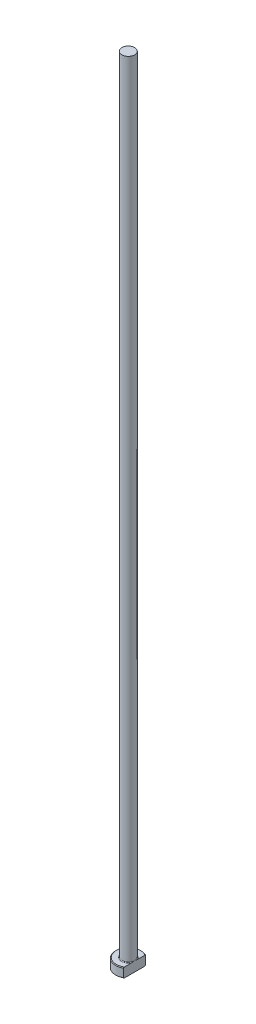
ISO-10303-21;
HEADER;
FILE_DESCRIPTION(('STEP AP214'),'2;1');
FILE_NAME('part.step','',(''),(''),'','','');
FILE_SCHEMA(('AUTOMOTIVE_DESIGN { 1 0 10303 214 1 1 1 1 }'));
ENDSEC;
DATA;
#1=APPLICATION_CONTEXT('core data for automotive mechanical design processes');
#2=APPLICATION_PROTOCOL_DEFINITION('international standard','automotive_design',2000,#1);
#3=PRODUCT_CONTEXT('',#1,'mechanical');
#4=PRODUCT('Part','Part','',(#3));
#5=PRODUCT_RELATED_PRODUCT_CATEGORY('part','',(#4));
#6=PRODUCT_DEFINITION_FORMATION('','',#4);
#7=PRODUCT_DEFINITION_CONTEXT('part definition',#1,'design');
#8=PRODUCT_DEFINITION('design','',#6,#7);
#9=PRODUCT_DEFINITION_SHAPE('','',#8);
#10=(LENGTH_UNIT() NAMED_UNIT(*) SI_UNIT(.MILLI.,.METRE.));
#11=(NAMED_UNIT(*) PLANE_ANGLE_UNIT() SI_UNIT($,.RADIAN.));
#12=(NAMED_UNIT(*) SI_UNIT($,.STERADIAN.) SOLID_ANGLE_UNIT());
#13=UNCERTAINTY_MEASURE_WITH_UNIT(LENGTH_MEASURE(1.E-05),#10,'distance_accuracy_value','');
#14=(GEOMETRIC_REPRESENTATION_CONTEXT(3) GLOBAL_UNCERTAINTY_ASSIGNED_CONTEXT((#13)) GLOBAL_UNIT_ASSIGNED_CONTEXT((#10,
#11,#12)) REPRESENTATION_CONTEXT('',''));
#15=CARTESIAN_POINT('',(0.,0.,0.));
#16=DIRECTION('',(0.,0.,1.));
#17=DIRECTION('',(1.,0.,0.));
#18=AXIS2_PLACEMENT_3D('',#15,#16,#17);
#19=CARTESIAN_POINT('',(0.,0.,0.));
#20=DIRECTION('',(0.,-1.,0.));
#21=DIRECTION('',(0.,0.,-1.));
#22=AXIS2_PLACEMENT_3D('',#19,#20,#21);
#23=PLANE('',#22);
#24=CARTESIAN_POINT('',(0.,0.,0.));
#25=DIRECTION('',(0.,-1.,0.));
#26=DIRECTION('',(0.,0.,-1.));
#27=AXIS2_PLACEMENT_3D('',#24,#25,#26);
#28=CIRCLE('',#27,3.79999999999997);
#29=CARTESIAN_POINT('',(1.99999999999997,0.,3.23109888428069));
#30=VERTEX_POINT('',#29);
#31=CARTESIAN_POINT('',(1.99999999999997,0.,-3.23109888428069));
#32=VERTEX_POINT('',#31);
#33=EDGE_CURVE('E98',#30,#32,#28,.T.);
#34=ORIENTED_EDGE('',*,*,#33,.T.);
#35=DIRECTION('',(0.,0.,1.));
#36=VECTOR('',#35,1.);
#37=CARTESIAN_POINT('',(1.99999999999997,0.,-3.46410161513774));
#38=LINE('',#37,#36);
#39=EDGE_CURVE('E83',#32,#30,#38,.T.);
#40=ORIENTED_EDGE('',*,*,#39,.T.);
#41=EDGE_LOOP('',(#34,#40));
#42=FACE_BOUND('',#41,.T.);
#43=ADVANCED_FACE('F32',(#42),#23,.T.);
#44=CARTESIAN_POINT('',(0.,259.958771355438,0.));
#45=DIRECTION('',(0.,1.,0.));
#46=DIRECTION('',(0.,0.,1.));
#47=AXIS2_PLACEMENT_3D('',#44,#45,#46);
#48=CYLINDRICAL_SURFACE('',#47,3.99999999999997);
#49=CARTESIAN_POINT('',(0.,2.80000000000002,0.));
#50=DIRECTION('',(0.,1.,0.));
#51=DIRECTION('',(0.,0.,1.));
#52=AXIS2_PLACEMENT_3D('',#49,#50,#51);
#53=CIRCLE('',#52,3.99999999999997);
#54=CARTESIAN_POINT('',(1.99999999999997,2.80000000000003,3.46410161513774));
#55=VERTEX_POINT('',#54);
#56=CARTESIAN_POINT('',(1.99999999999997,2.80000000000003,-3.46410161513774));
#57=VERTEX_POINT('',#56);
#58=EDGE_CURVE('E104',#55,#57,#53,.F.);
#59=ORIENTED_EDGE('',*,*,#58,.T.);
#60=DIRECTION('',(0.,-1.,0.));
#61=VECTOR('',#60,1.);
#62=CARTESIAN_POINT('',(1.99999999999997,250.,-3.46410161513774));
#63=LINE('',#62,#61);
#64=CARTESIAN_POINT('',(1.99999999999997,0.200000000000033,-3.46410161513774));
#65=VERTEX_POINT('',#64);
#66=EDGE_CURVE('E183',#57,#65,#63,.T.);
#67=ORIENTED_EDGE('',*,*,#66,.T.);
#68=CARTESIAN_POINT('',(0.,0.200000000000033,0.));
#69=DIRECTION('',(0.,-1.,0.));
#70=DIRECTION('',(0.,0.,-1.));
#71=AXIS2_PLACEMENT_3D('',#68,#69,#70);
#72=CIRCLE('',#71,3.99999999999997);
#73=CARTESIAN_POINT('',(1.99999999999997,0.200000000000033,3.46410161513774));
#74=VERTEX_POINT('',#73);
#75=EDGE_CURVE('E100',#65,#74,#72,.F.);
#76=ORIENTED_EDGE('',*,*,#75,.T.);
#77=DIRECTION('',(0.,-1.,0.));
#78=VECTOR('',#77,1.);
#79=CARTESIAN_POINT('',(1.99999999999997,250.,3.46410161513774));
#80=LINE('',#79,#78);
#81=EDGE_CURVE('E93',#55,#74,#80,.T.);
#82=ORIENTED_EDGE('',*,*,#81,.F.);
#83=EDGE_LOOP('',(#59,#67,#76,#82));
#84=FACE_BOUND('',#83,.T.);
#85=ADVANCED_FACE('F158',(#84),#48,.T.);
#86=CARTESIAN_POINT('',(-3.99999999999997,3.,0.));
#87=DIRECTION('',(0.,1.,0.));
#88=DIRECTION('',(0.,0.,1.));
#89=AXIS2_PLACEMENT_3D('',#86,#87,#88);
#90=PLANE('',#89);
#91=CARTESIAN_POINT('',(0.,3.,0.));
#92=DIRECTION('',(0.,1.,0.));
#93=DIRECTION('',(0.,0.,1.));
#94=AXIS2_PLACEMENT_3D('',#91,#92,#93);
#95=CIRCLE('',#94,3.8);
#96=CARTESIAN_POINT('',(1.99999999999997,3.,-3.23109888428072));
#97=VERTEX_POINT('',#96);
#98=CARTESIAN_POINT('',(1.99999999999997,3.,3.23109888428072));
#99=VERTEX_POINT('',#98);
#100=EDGE_CURVE('E178',#97,#99,#95,.T.);
#101=ORIENTED_EDGE('',*,*,#100,.T.);
#102=DIRECTION('',(0.,0.,-1.));
#103=VECTOR('',#102,1.);
#104=CARTESIAN_POINT('',(1.99999999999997,3.,0.));
#105=LINE('',#104,#103);
#106=CARTESIAN_POINT('',(1.99999999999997,2.99999999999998,0.916515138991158));
#107=VERTEX_POINT('',#106);
#108=EDGE_CURVE('E57',#99,#107,#105,.T.);
#109=ORIENTED_EDGE('',*,*,#108,.T.);
#110=CARTESIAN_POINT('',(0.,3.,0.));
#111=DIRECTION('',(0.,1.,0.));
#112=DIRECTION('',(0.,0.,1.));
#113=AXIS2_PLACEMENT_3D('',#110,#111,#112);
#114=CIRCLE('',#113,2.19999999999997);
#115=CARTESIAN_POINT('',(1.99999999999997,2.99999999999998,-0.9165151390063));
#116=VERTEX_POINT('',#115);
#117=EDGE_CURVE('E107',#107,#116,#114,.F.);
#118=ORIENTED_EDGE('',*,*,#117,.T.);
#119=EDGE_CURVE('E136',#116,#97,#105,.T.);
#120=ORIENTED_EDGE('',*,*,#119,.T.);
#121=EDGE_LOOP('',(#101,#109,#118,#120));
#122=FACE_BOUND('',#121,.T.);
#123=ADVANCED_FACE('F147',(#122),#90,.T.);
#124=CARTESIAN_POINT('',(0.,3.,0.));
#125=DIRECTION('',(0.,-1.,0.));
#126=DIRECTION('',(0.,0.,-1.));
#127=AXIS2_PLACEMENT_3D('',#124,#125,#126);
#128=CONICAL_SURFACE('',#127,3.8,0.785398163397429);
#129=ORIENTED_EDGE('',*,*,#58,.F.);
#130=CARTESIAN_POINT('',(1.99999999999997,-1.08095467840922,7.62295524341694));
#131=CARTESIAN_POINT('',(1.99999999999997,-0.913887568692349,7.45022392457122));
#132=CARTESIAN_POINT('',(1.99999999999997,-0.746999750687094,7.27731861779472));
#133=CARTESIAN_POINT('',(1.99999999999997,-0.413688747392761,6.9310565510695));
#134=CARTESIAN_POINT('',(1.99999999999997,-0.247265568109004,6.75769978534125));
#135=CARTESIAN_POINT('',(1.99999999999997,0.0850908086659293,6.41034692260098));
#136=CARTESIAN_POINT('',(1.99999999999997,0.251023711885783,6.23635054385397));
#137=CARTESIAN_POINT('',(1.99999999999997,0.582155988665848,5.88766284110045));
#138=CARTESIAN_POINT('',(1.99999999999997,0.747355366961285,5.71297152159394));
#139=CARTESIAN_POINT('',(1.99999999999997,1.07353855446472,5.36616839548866));
#140=CARTESIAN_POINT('',(1.99999999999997,1.23454099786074,5.19407412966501));
#141=CARTESIAN_POINT('',(1.99999999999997,1.55534102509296,4.84876663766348));
#142=CARTESIAN_POINT('',(1.99999999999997,1.71513861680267,4.67555341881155));
#143=CARTESIAN_POINT('',(1.99999999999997,2.03306183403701,4.32766569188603));
#144=CARTESIAN_POINT('',(1.99999999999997,2.19118781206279,4.15299150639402));
#145=CARTESIAN_POINT('',(1.99999999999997,2.5051394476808,3.80159134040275));
#146=CARTESIAN_POINT('',(1.99999999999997,2.66096519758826,3.62486544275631));
#147=CARTESIAN_POINT('',(1.99999999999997,2.90974646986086,3.33722425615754));
#148=CARTESIAN_POINT('',(1.99999999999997,3.00376148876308,3.22722645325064));
#149=CARTESIAN_POINT('',(1.99999999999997,3.1901182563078,3.00579987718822));
#150=CARTESIAN_POINT('',(1.99999999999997,3.28245983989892,2.89437096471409));
#151=CARTESIAN_POINT('',(1.99999999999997,3.46586188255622,2.66849662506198));
#152=CARTESIAN_POINT('',(1.99999999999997,3.55689849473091,2.55403176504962));
#153=CARTESIAN_POINT('',(1.99999999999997,3.73578809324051,2.32266819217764));
#154=CARTESIAN_POINT('',(1.99999999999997,3.82364184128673,2.20577007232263));
#155=CARTESIAN_POINT('',(1.99999999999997,3.9961275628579,1.96688707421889));
#156=CARTESIAN_POINT('',(1.99999999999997,4.08069035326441,1.84485190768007));
#157=CARTESIAN_POINT('',(1.99999999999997,4.24300264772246,1.59599329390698));
#158=CARTESIAN_POINT('',(1.99999999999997,4.32074277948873,1.46916359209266));
#159=CARTESIAN_POINT('',(1.99999999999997,4.4286976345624,1.27510066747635));
#160=CARTESIAN_POINT('',(1.99999999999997,4.46305374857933,1.21018943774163));
#161=CARTESIAN_POINT('',(1.99999999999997,4.5283714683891,1.07868835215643));
#162=CARTESIAN_POINT('',(1.99999999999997,4.55933245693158,1.01209819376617));
#163=CARTESIAN_POINT('',(1.99999999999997,4.64566860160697,0.80989435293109));
#164=CARTESIAN_POINT('',(1.99999999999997,4.6947821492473,0.671360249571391));
#165=CARTESIAN_POINT('',(1.99999999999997,4.74794829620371,0.46365745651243));
#166=CARTESIAN_POINT('',(1.99999999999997,4.76205065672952,0.397033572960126));
#167=CARTESIAN_POINT('',(1.99999999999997,4.78390371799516,0.262728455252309));
#168=CARTESIAN_POINT('',(1.99999999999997,4.79165498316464,0.195047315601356));
#169=CARTESIAN_POINT('',(1.99999999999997,4.8002569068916,0.0594528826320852));
#170=CARTESIAN_POINT('',(1.99999999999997,4.80112894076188,-0.00845903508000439));
#171=CARTESIAN_POINT('',(1.99999999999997,4.79596585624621,-0.144020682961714));
#172=CARTESIAN_POINT('',(1.99999999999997,4.78993016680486,-0.211670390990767));
#173=CARTESIAN_POINT('',(1.99999999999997,4.77145363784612,-0.34548399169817));
#174=CARTESIAN_POINT('',(1.99999999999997,4.75906777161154,-0.411655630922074));
#175=CARTESIAN_POINT('',(1.99999999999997,4.72866360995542,-0.542678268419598));
#176=CARTESIAN_POINT('',(1.99999999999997,4.71064463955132,-0.60752910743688));
#177=CARTESIAN_POINT('',(1.99999999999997,4.66972939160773,-0.736064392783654));
#178=CARTESIAN_POINT('',(1.99999999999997,4.64680564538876,-0.799739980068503));
#179=CARTESIAN_POINT('',(1.99999999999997,4.59700147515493,-0.925489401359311));
#180=CARTESIAN_POINT('',(1.99999999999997,4.57012185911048,-0.987563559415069));
#181=CARTESIAN_POINT('',(1.99999999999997,4.48443518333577,-1.17209020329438));
#182=CARTESIAN_POINT('',(1.99999999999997,4.42077407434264,-1.29228210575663));
#183=CARTESIAN_POINT('',(1.99999999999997,4.2850264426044,-1.52785770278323));
#184=CARTESIAN_POINT('',(1.99999999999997,4.21292931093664,-1.64323509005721));
#185=CARTESIAN_POINT('',(1.99999999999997,4.06281517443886,-1.87069387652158));
#186=CARTESIAN_POINT('',(1.99999999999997,3.9847759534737,-1.98276048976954));
#187=CARTESIAN_POINT('',(1.99999999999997,3.82481971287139,-2.20397837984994));
#188=CARTESIAN_POINT('',(1.99999999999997,3.74290465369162,-2.31313108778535));
#189=CARTESIAN_POINT('',(1.99999999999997,3.57517222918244,-2.53068545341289));
#190=CARTESIAN_POINT('',(1.99999999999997,3.4893176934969,-2.63905831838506));
#191=CARTESIAN_POINT('',(1.99999999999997,3.31548151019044,-2.85409686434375));
#192=CARTESIAN_POINT('',(1.99999999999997,3.22749963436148,-2.96076236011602));
#193=CARTESIAN_POINT('',(1.99999999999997,3.05015030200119,-3.17249211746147));
#194=CARTESIAN_POINT('',(1.99999999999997,2.96078672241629,-3.27755963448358));
#195=CARTESIAN_POINT('',(1.99999999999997,2.78082366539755,-3.48663191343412));
#196=CARTESIAN_POINT('',(1.99999999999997,2.69022416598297,-3.5906366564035));
#197=CARTESIAN_POINT('',(1.99999999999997,2.44796733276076,-3.86612439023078));
#198=CARTESIAN_POINT('',(1.99999999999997,2.29545972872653,-4.03685912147));
#199=CARTESIAN_POINT('',(1.99999999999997,1.98858070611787,-4.37664803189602));
#200=CARTESIAN_POINT('',(1.99999999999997,1.83420923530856,-4.54570216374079));
#201=CARTESIAN_POINT('',(1.99999999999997,1.52396102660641,-4.88271638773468));
#202=CARTESIAN_POINT('',(1.99999999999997,1.36808300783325,-5.05067529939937));
#203=CARTESIAN_POINT('',(1.99999999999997,1.05530513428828,-5.38563883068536));
#204=CARTESIAN_POINT('',(1.99999999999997,0.898405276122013,-5.55264344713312));
#205=CARTESIAN_POINT('',(1.99999999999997,0.590290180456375,-5.87905385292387));
#206=CARTESIAN_POINT('',(1.99999999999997,0.439106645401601,-6.03848959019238));
#207=CARTESIAN_POINT('',(1.99999999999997,0.136164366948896,-6.35681456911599));
#208=CARTESIAN_POINT('',(1.99999999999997,-0.0155943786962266,-6.51570380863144));
#209=CARTESIAN_POINT('',(1.99999999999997,-0.319404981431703,-6.83286192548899));
#210=CARTESIAN_POINT('',(1.99999999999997,-0.471456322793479,-6.99113129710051));
#211=CARTESIAN_POINT('',(1.99999999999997,-0.775939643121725,-7.30730102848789));
#212=CARTESIAN_POINT('',(1.99999999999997,-0.928371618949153,-7.46520139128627));
#213=CARTESIAN_POINT('',(1.99999999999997,-1.08095467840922,-7.62295524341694));
#214=B_SPLINE_CURVE_WITH_KNOTS('',3,(#130,#131,#132,#133,#134,#135,#136,#137,#138,#139,#140,
#141,#142,#143,#144,#145,#146,#147,#148,#149,#150,#151,#152,#153,#154,#155,#156,#157,#158,#159,
#160,#161,#162,#163,#164,#165,#166,#167,#168,#169,#170,#171,#172,#173,#174,#175,#176,#177,#178,
#179,#180,#181,#182,#183,#184,#185,#186,#187,#188,#189,#190,#191,#192,#193,#194,#195,#196,#197,
#198,#199,#200,#201,#202,#203,#204,#205,#206,#207,#208,#209,#210,#211,#212,#213),.UNSPECIFIED.,
.F.,.F.,(4,2,2,2,2,2,2,2,2,2,2,2,2,2,2,2,2,2,2,2,2,2,2,2,2,2,2,2,2,2,2,2,2,2,2,2,2,2,2,2,2,4),
(0.,0.720921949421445,1.44185317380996,2.1631532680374,2.88444869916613,3.59144103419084,
4.29842874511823,5.005264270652,5.71207135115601,6.14616174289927,6.58029471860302,
7.01901494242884,7.45762947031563,7.90290456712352,8.34878206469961,8.56901415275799,
8.7892862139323,9.22814472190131,9.43219512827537,9.63622739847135,9.8396254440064,
10.0430403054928,10.2447232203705,10.4464303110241,10.6492980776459,10.8521244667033,
11.259558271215,11.6675100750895,12.0770700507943,12.4864250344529,12.901167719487,
13.3159550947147,13.7297367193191,14.1435257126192,14.8302935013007,15.5170805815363,
16.2045145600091,16.8919508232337,17.5511045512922,18.2102608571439,18.86868195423,
19.5270976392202),.UNSPECIFIED.);
#215=EDGE_CURVE('E135',#55,#99,#214,.T.);
#216=ORIENTED_EDGE('',*,*,#215,.T.);
#217=ORIENTED_EDGE('',*,*,#100,.F.);
#218=EDGE_CURVE('E127',#97,#57,#214,.T.);
#219=ORIENTED_EDGE('',*,*,#218,.T.);
#220=EDGE_LOOP('',(#129,#216,#217,#219));
#221=FACE_BOUND('',#220,.T.);
#222=ADVANCED_FACE('F143',(#221),#128,.T.);
#223=CARTESIAN_POINT('',(0.,0.200000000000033,0.));
#224=DIRECTION('',(0.,1.,0.));
#225=DIRECTION('',(0.,0.,1.));
#226=AXIS2_PLACEMENT_3D('',#223,#224,#225);
#227=CONICAL_SURFACE('',#226,3.99999999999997,0.785398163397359);
#228=ORIENTED_EDGE('',*,*,#75,.F.);
#229=CARTESIAN_POINT('',(1.99999999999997,4.08095467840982,-7.62295524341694));
#230=CARTESIAN_POINT('',(1.99999999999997,3.9138875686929,-7.4502239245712));
#231=CARTESIAN_POINT('',(1.99999999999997,3.74699975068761,-7.27731861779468));
#232=CARTESIAN_POINT('',(1.99999999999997,3.4136887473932,-6.93105655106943));
#233=CARTESIAN_POINT('',(1.99999999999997,3.2472655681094,-6.75769978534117));
#234=CARTESIAN_POINT('',(1.99999999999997,2.91490919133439,-6.41034692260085));
#235=CARTESIAN_POINT('',(1.99999999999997,2.74897628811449,-6.23635054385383));
#236=CARTESIAN_POINT('',(1.99999999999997,2.41784401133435,-5.88766284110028));
#237=CARTESIAN_POINT('',(1.99999999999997,2.25264463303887,-5.71297152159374));
#238=CARTESIAN_POINT('',(1.99999999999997,1.92646144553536,-5.36616839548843));
#239=CARTESIAN_POINT('',(1.99999999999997,1.7654590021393,-5.19407412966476));
#240=CARTESIAN_POINT('',(1.99999999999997,1.44465897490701,-4.8487666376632));
#241=CARTESIAN_POINT('',(1.99999999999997,1.28486138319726,-4.67555341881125));
#242=CARTESIAN_POINT('',(1.99999999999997,0.966938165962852,-4.3276656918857));
#243=CARTESIAN_POINT('',(1.99999999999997,0.808812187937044,-4.15299150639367));
#244=CARTESIAN_POINT('',(1.99999999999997,0.494860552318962,-3.80159134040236));
#245=CARTESIAN_POINT('',(1.99999999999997,0.339034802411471,-3.62486544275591));
#246=CARTESIAN_POINT('',(1.99999999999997,0.0902535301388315,-3.33722425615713));
#247=CARTESIAN_POINT('',(1.99999999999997,-0.00376148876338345,-3.22722645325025));
#248=CARTESIAN_POINT('',(1.99999999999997,-0.190118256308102,-3.00579987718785));
#249=CARTESIAN_POINT('',(1.99999999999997,-0.282459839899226,-2.89437096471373));
#250=CARTESIAN_POINT('',(1.99999999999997,-0.465861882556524,-2.66849662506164));
#251=CARTESIAN_POINT('',(1.99999999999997,-0.556898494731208,-2.55403176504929));
#252=CARTESIAN_POINT('',(1.99999999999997,-0.735788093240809,-2.32266819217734));
#253=CARTESIAN_POINT('',(1.99999999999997,-0.82364184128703,-2.20577007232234));
#254=CARTESIAN_POINT('',(1.99999999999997,-0.996127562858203,-1.96688707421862));
#255=CARTESIAN_POINT('',(1.99999999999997,-1.08069035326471,-1.84485190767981));
#256=CARTESIAN_POINT('',(1.99999999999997,-1.24300264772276,-1.59599329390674));
#257=CARTESIAN_POINT('',(1.99999999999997,-1.32074277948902,-1.46916359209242));
#258=CARTESIAN_POINT('',(1.99999999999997,-1.42869763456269,-1.27510066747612));
#259=CARTESIAN_POINT('',(1.99999999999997,-1.46305374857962,-1.2101894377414));
#260=CARTESIAN_POINT('',(1.99999999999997,-1.52837146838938,-1.07868835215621));
#261=CARTESIAN_POINT('',(1.99999999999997,-1.55933245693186,-1.01209819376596));
#262=CARTESIAN_POINT('',(1.99999999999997,-1.64566860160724,-0.80989435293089));
#263=CARTESIAN_POINT('',(1.99999999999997,-1.69478214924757,-0.671360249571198));
#264=CARTESIAN_POINT('',(1.99999999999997,-1.74794829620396,-0.463657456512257));
#265=CARTESIAN_POINT('',(1.99999999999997,-1.76205065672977,-0.397033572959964));
#266=CARTESIAN_POINT('',(1.99999999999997,-1.78390371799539,-0.262728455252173));
#267=CARTESIAN_POINT('',(1.99999999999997,-1.79165498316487,-0.195047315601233));
#268=CARTESIAN_POINT('',(1.99999999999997,-1.80025690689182,-0.0594528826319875));
#269=CARTESIAN_POINT('',(1.99999999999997,-1.8011289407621,0.00845903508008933));
#270=CARTESIAN_POINT('',(1.99999999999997,-1.79596585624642,0.144020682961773));
#271=CARTESIAN_POINT('',(1.99999999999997,-1.78993016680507,0.211670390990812));
#272=CARTESIAN_POINT('',(1.99999999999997,-1.77145363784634,0.345483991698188));
#273=CARTESIAN_POINT('',(1.99999999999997,-1.75906777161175,0.411655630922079));
#274=CARTESIAN_POINT('',(1.99999999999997,-1.72866360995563,0.542678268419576));
#275=CARTESIAN_POINT('',(1.99999999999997,-1.71064463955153,0.607529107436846));
#276=CARTESIAN_POINT('',(1.99999999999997,-1.66972939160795,0.736064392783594));
#277=CARTESIAN_POINT('',(1.99999999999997,-1.64680564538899,0.799739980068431));
#278=CARTESIAN_POINT('',(1.99999999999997,-1.59700147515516,0.925489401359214));
#279=CARTESIAN_POINT('',(1.99999999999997,-1.57012185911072,0.987563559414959));
#280=CARTESIAN_POINT('',(1.99999999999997,-1.48443518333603,1.17209020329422));
#281=CARTESIAN_POINT('',(1.99999999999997,-1.42077407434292,1.29228210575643));
#282=CARTESIAN_POINT('',(1.99999999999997,-1.28502644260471,1.52785770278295));
#283=CARTESIAN_POINT('',(1.99999999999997,-1.21292931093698,1.6432350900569));
#284=CARTESIAN_POINT('',(1.99999999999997,-1.06281517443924,1.87069387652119));
#285=CARTESIAN_POINT('',(1.99999999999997,-0.984775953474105,1.98276048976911));
#286=CARTESIAN_POINT('',(1.99999999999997,-0.824819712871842,2.20397837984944));
#287=CARTESIAN_POINT('',(1.99999999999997,-0.742904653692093,2.31313108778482));
#288=CARTESIAN_POINT('',(1.99999999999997,-0.575172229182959,2.53068545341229));
#289=CARTESIAN_POINT('',(1.99999999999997,-0.489317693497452,2.63905831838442));
#290=CARTESIAN_POINT('',(1.99999999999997,-0.315481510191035,2.85409686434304));
#291=CARTESIAN_POINT('',(1.99999999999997,-0.227499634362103,2.96076236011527));
#292=CARTESIAN_POINT('',(1.99999999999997,-0.0501503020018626,3.17249211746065));
#293=CARTESIAN_POINT('',(1.99999999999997,0.0392132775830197,3.27755963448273));
#294=CARTESIAN_POINT('',(1.99999999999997,0.219176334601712,3.48663191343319));
#295=CARTESIAN_POINT('',(1.99999999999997,0.309775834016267,3.59063665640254));
#296=CARTESIAN_POINT('',(1.99999999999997,0.552032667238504,3.86612439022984));
#297=CARTESIAN_POINT('',(1.99999999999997,0.70454027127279,4.0368591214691));
#298=CARTESIAN_POINT('',(1.99999999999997,1.01141929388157,4.37664803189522));
#299=CARTESIAN_POINT('',(1.99999999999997,1.16579076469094,4.54570216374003));
#300=CARTESIAN_POINT('',(1.99999999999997,1.47603897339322,4.88271638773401));
#301=CARTESIAN_POINT('',(1.99999999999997,1.63191699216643,5.05067529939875));
#302=CARTESIAN_POINT('',(1.99999999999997,1.94469486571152,5.38563883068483));
#303=CARTESIAN_POINT('',(1.99999999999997,2.10159472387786,5.55264344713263));
#304=CARTESIAN_POINT('',(1.99999999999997,2.40970981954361,5.87905385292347));
#305=CARTESIAN_POINT('',(1.99999999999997,2.56089335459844,6.03848959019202));
#306=CARTESIAN_POINT('',(1.99999999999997,2.86383563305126,6.35681456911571));
#307=CARTESIAN_POINT('',(1.99999999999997,3.01559437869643,6.51570380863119));
#308=CARTESIAN_POINT('',(1.99999999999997,3.31940498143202,6.83286192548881));
#309=CARTESIAN_POINT('',(1.99999999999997,3.47145632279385,6.99113129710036));
#310=CARTESIAN_POINT('',(1.99999999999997,3.77593964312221,7.30730102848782));
#311=CARTESIAN_POINT('',(1.99999999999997,3.92837161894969,7.46520139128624));
#312=CARTESIAN_POINT('',(1.99999999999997,4.08095467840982,7.62295524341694));
#313=B_SPLINE_CURVE_WITH_KNOTS('',3,(#229,#230,#231,#232,#233,#234,#235,#236,#237,#238,#239,
#240,#241,#242,#243,#244,#245,#246,#247,#248,#249,#250,#251,#252,#253,#254,#255,#256,#257,#258,
#259,#260,#261,#262,#263,#264,#265,#266,#267,#268,#269,#270,#271,#272,#273,#274,#275,#276,#277,
#278,#279,#280,#281,#282,#283,#284,#285,#286,#287,#288,#289,#290,#291,#292,#293,#294,#295,#296,
#297,#298,#299,#300,#301,#302,#303,#304,#305,#306,#307,#308,#309,#310,#311,#312),.UNSPECIFIED.,
.F.,.F.,(4,2,2,2,2,2,2,2,2,2,2,2,2,2,2,2,2,2,2,2,2,2,2,2,2,2,2,2,2,2,2,2,2,2,2,2,2,2,2,2,2,4),
(0.,0.720921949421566,1.4418531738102,2.16315326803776,2.88444869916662,3.59144103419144,
4.29842874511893,5.00526427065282,5.71207135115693,6.14616174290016,6.58029471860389,
7.01901494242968,7.45762947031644,7.90290456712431,8.34878206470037,8.56901415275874,
8.78928621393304,9.22814472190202,9.43219512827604,9.63622739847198,9.83962544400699,
10.0430403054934,10.244723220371,10.4464303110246,10.6492980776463,10.8521244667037,
11.2595582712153,11.6675100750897,12.0770700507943,12.4864250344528,12.9011677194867,
13.3159550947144,13.7297367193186,14.1435257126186,14.8302935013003,15.5170805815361,
16.2045145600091,16.891950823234,17.5511045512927,18.2102608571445,18.8686819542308,
19.5270976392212),.UNSPECIFIED.);
#314=EDGE_CURVE('E86',#65,#32,#313,.T.);
#315=ORIENTED_EDGE('',*,*,#314,.T.);
#316=ORIENTED_EDGE('',*,*,#33,.F.);
#317=EDGE_CURVE('E89',#30,#74,#313,.T.);
#318=ORIENTED_EDGE('',*,*,#317,.T.);
#319=EDGE_LOOP('',(#228,#315,#316,#318));
#320=FACE_BOUND('',#319,.T.);
#321=ADVANCED_FACE('F97',(#320),#227,.T.);
#322=CARTESIAN_POINT('',(0.,3.19999999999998,0.));
#323=DIRECTION('',(0.,1.,0.));
#324=DIRECTION('',(0.,0.,1.));
#325=AXIS2_PLACEMENT_3D('',#322,#323,#324);
#326=TOROIDAL_SURFACE('',#325,2.19999999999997,0.2);
#327=CARTESIAN_POINT('',(1.99999999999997,3.19999999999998,0.));
#328=CARTESIAN_POINT('',(1.99999999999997,3.20000050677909,1.13930257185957E-10));
#329=CARTESIAN_POINT('',(1.99999999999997,3.20000101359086,-1.46766790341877E-07));
#330=CARTESIAN_POINT('',(1.99999999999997,3.20000197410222,-5.82067439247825E-07));
#331=CARTESIAN_POINT('',(1.99999999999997,3.20000242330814,-8.77873003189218E-07));
#332=CARTESIAN_POINT('',(1.99999999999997,3.20000333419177,-1.58424512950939E-06));
#333=CARTESIAN_POINT('',(1.99999999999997,3.20000378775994,-2.00534281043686E-06));
#334=CARTESIAN_POINT('',(1.99999999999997,3.20000462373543,-2.89558838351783E-06));
#335=CARTESIAN_POINT('',(1.99999999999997,3.20000500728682,-3.3637232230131E-06));
#336=CARTESIAN_POINT('',(1.99999999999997,3.20000636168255,-5.10887545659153E-06));
#337=CARTESIAN_POINT('',(1.99999999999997,3.2000072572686,-6.44597273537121E-06));
#338=CARTESIAN_POINT('',(1.99999999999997,3.20000879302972,-9.14926709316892E-06));
#339=CARTESIAN_POINT('',(1.99999999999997,3.20000944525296,-1.05089714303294E-05));
#340=CARTESIAN_POINT('',(1.99999999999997,3.20001204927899,-1.60555879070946E-05));
#341=CARTESIAN_POINT('',(1.99999999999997,3.20001390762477,-2.02908746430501E-05));
#342=CARTESIAN_POINT('',(1.99999999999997,3.20001676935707,-2.84438492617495E-05));
#343=CARTESIAN_POINT('',(1.99999999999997,3.2000178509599,-3.23343257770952E-05));
#344=CARTESIAN_POINT('',(1.99999999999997,3.20002551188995,-6.06027142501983E-05));
#345=CARTESIAN_POINT('',(1.99999999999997,3.20003111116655,-8.51991843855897E-05));
#346=CARTESIAN_POINT('',(1.99999999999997,3.20005559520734,-0.000181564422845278));
#347=CARTESIAN_POINT('',(1.99999999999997,3.20007914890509,-0.00025209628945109));
#348=CARTESIAN_POINT('',(1.99999999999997,3.20017002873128,-0.000529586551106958));
#349=CARTESIAN_POINT('',(1.99999999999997,3.20023415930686,-0.000737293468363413));
#350=CARTESIAN_POINT('',(1.99999999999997,3.20048926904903,-0.00155657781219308));
#351=CARTESIAN_POINT('',(1.99999999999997,3.20068414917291,-0.00216722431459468));
#352=CARTESIAN_POINT('',(1.99999999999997,3.20148805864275,-0.00469384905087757));
#353=CARTESIAN_POINT('',(1.99999999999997,3.20209226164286,-0.00661098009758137));
#354=CARTESIAN_POINT('',(1.99999999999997,3.20822779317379,-0.026069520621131));
#355=CARTESIAN_POINT('',(1.99999999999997,3.21378174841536,-0.0436057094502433));
#356=CARTESIAN_POINT('',(1.99999999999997,3.22462834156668,-0.0780127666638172));
#357=CARTESIAN_POINT('',(1.99999999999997,3.2299227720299,-0.0948831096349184));
#358=CARTESIAN_POINT('',(1.99999999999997,3.24110477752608,-0.130713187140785));
#359=CARTESIAN_POINT('',(1.99999999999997,3.24698536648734,-0.149675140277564));
#360=CARTESIAN_POINT('',(1.99999999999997,3.2586983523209,-0.187834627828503));
#361=CARTESIAN_POINT('',(1.99999999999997,3.26452957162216,-0.207032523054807));
#362=CARTESIAN_POINT('',(1.99999999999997,3.27861584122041,-0.254071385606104));
#363=CARTESIAN_POINT('',(1.99999999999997,3.28678835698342,-0.281937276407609));
#364=CARTESIAN_POINT('',(1.99999999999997,3.30249503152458,-0.337115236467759));
#365=CARTESIAN_POINT('',(1.99999999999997,3.31003989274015,-0.36442425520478));
#366=CARTESIAN_POINT('',(1.99999999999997,3.32554795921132,-0.422841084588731));
#367=CARTESIAN_POINT('',(1.99999999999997,3.33343288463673,-0.453970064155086));
#368=CARTESIAN_POINT('',(1.99999999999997,3.34833120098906,-0.516667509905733));
#369=CARTESIAN_POINT('',(1.99999999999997,3.3553379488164,-0.548237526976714));
#370=CARTESIAN_POINT('',(1.99999999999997,3.37554978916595,-0.647984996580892));
#371=CARTESIAN_POINT('',(1.99999999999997,3.38665117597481,-0.716635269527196));
#372=CARTESIAN_POINT('',(1.99999999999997,3.39785773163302,-0.832445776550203));
#373=CARTESIAN_POINT('',(1.99999999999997,3.40036304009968,-0.879345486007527));
#374=CARTESIAN_POINT('',(1.99999999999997,3.3997602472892,-0.94923898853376));
#375=CARTESIAN_POINT('',(1.99999999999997,3.39886048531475,-0.972248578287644));
#376=CARTESIAN_POINT('',(1.99999999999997,3.39534463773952,-1.01812773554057));
#377=CARTESIAN_POINT('',(1.99999999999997,3.39273014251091,-1.04099741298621));
#378=CARTESIAN_POINT('',(1.99999999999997,3.38623968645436,-1.08102660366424));
#379=CARTESIAN_POINT('',(1.99999999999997,3.38280841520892,-1.09825717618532));
#380=CARTESIAN_POINT('',(1.99999999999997,3.37442567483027,-1.13243508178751));
#381=CARTESIAN_POINT('',(1.99999999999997,3.36946777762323,-1.14938089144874));
#382=CARTESIAN_POINT('',(1.99999999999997,3.35764172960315,-1.18276398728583));
#383=CARTESIAN_POINT('',(1.99999999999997,3.3507581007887,-1.19919590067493));
#384=CARTESIAN_POINT('',(1.99999999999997,3.33462082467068,-1.23083581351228));
#385=CARTESIAN_POINT('',(1.99999999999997,3.32537783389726,-1.24604892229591));
#386=CARTESIAN_POINT('',(1.99999999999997,3.30929159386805,-1.26715296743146));
#387=CARTESIAN_POINT('',(1.99999999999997,3.30356769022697,-1.27389441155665));
#388=CARTESIAN_POINT('',(1.99999999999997,3.29128925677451,-1.28659894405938));
#389=CARTESIAN_POINT('',(1.99999999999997,3.28473413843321,-1.2925614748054));
#390=CARTESIAN_POINT('',(1.99999999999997,3.27066594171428,-1.30346436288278));
#391=CARTESIAN_POINT('',(1.99999999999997,3.26314132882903,-1.30839014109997));
#392=CARTESIAN_POINT('',(1.99999999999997,3.24727957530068,-1.31668687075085));
#393=CARTESIAN_POINT('',(1.99999999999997,3.23894498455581,-1.32006252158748));
#394=CARTESIAN_POINT('',(1.99999999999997,3.22424089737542,-1.3241557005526));
#395=CARTESIAN_POINT('',(1.99999999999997,3.21800630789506,-1.32536112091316));
#396=CARTESIAN_POINT('',(1.99999999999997,3.20542266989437,-1.32669615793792));
#397=CARTESIAN_POINT('',(1.99999999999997,3.19907368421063,-1.32682634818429));
#398=CARTESIAN_POINT('',(1.99999999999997,3.18645152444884,-1.32599950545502));
#399=CARTESIAN_POINT('',(1.99999999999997,3.18017831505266,-1.32504300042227));
#400=CARTESIAN_POINT('',(1.99999999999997,3.16787181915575,-1.32212308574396));
#401=CARTESIAN_POINT('',(1.99999999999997,3.16183869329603,-1.3201590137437));
#402=CARTESIAN_POINT('',(1.99999999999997,3.14844260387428,-1.3146656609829));
#403=CARTESIAN_POINT('',(1.99999999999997,3.14119825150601,-1.31084826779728));
#404=CARTESIAN_POINT('',(1.99999999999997,3.12742328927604,-1.30209252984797));
#405=CARTESIAN_POINT('',(1.99999999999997,3.12089414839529,-1.2971519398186));
#406=CARTESIAN_POINT('',(1.99999999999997,3.10554761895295,-1.28382084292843));
#407=CARTESIAN_POINT('',(1.99999999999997,3.09717242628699,-1.27492468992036));
#408=CARTESIAN_POINT('',(1.99999999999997,3.08188323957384,-1.25597903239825));
#409=CARTESIAN_POINT('',(1.99999999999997,3.07497120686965,-1.24592800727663));
#410=CARTESIAN_POINT('',(1.99999999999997,3.05771073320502,-1.21734573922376));
#411=CARTESIAN_POINT('',(1.99999999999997,3.04862251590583,-1.19806017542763));
#412=CARTESIAN_POINT('',(1.99999999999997,3.03323781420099,-1.15830155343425));
#413=CARTESIAN_POINT('',(1.99999999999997,3.02696471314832,-1.13782009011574));
#414=CARTESIAN_POINT('',(1.99999999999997,3.0165915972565,-1.09607450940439));
#415=CARTESIAN_POINT('',(1.99999999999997,3.0125177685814,-1.07480405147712));
#416=CARTESIAN_POINT('',(1.99999999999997,3.00618909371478,-1.03196822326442));
#417=CARTESIAN_POINT('',(1.99999999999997,3.00393768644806,-1.01040237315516));
#418=CARTESIAN_POINT('',(1.99999999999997,2.99950887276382,-0.94694819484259));
#419=CARTESIAN_POINT('',(1.99999999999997,2.99937097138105,-0.904921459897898));
#420=CARTESIAN_POINT('',(1.99999999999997,3.00391139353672,-0.800067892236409));
#421=CARTESIAN_POINT('',(1.99999999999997,3.01103947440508,-0.7373784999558));
#422=CARTESIAN_POINT('',(1.99999999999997,3.0310998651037,-0.611444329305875));
#423=CARTESIAN_POINT('',(1.99999999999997,3.04417074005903,-0.548223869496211));
#424=CARTESIAN_POINT('',(1.99999999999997,3.06920011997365,-0.442888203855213));
#425=CARTESIAN_POINT('',(1.99999999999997,3.08016343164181,-0.40052705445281));
#426=CARTESIAN_POINT('',(1.99999999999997,3.10315303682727,-0.316588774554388));
#427=CARTESIAN_POINT('',(1.99999999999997,3.11516655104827,-0.275008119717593));
#428=CARTESIAN_POINT('',(1.99999999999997,3.13853403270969,-0.196672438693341));
#429=CARTESIAN_POINT('',(1.99999999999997,3.14981294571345,-0.159894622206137));
#430=CARTESIAN_POINT('',(1.99999999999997,3.17316886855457,-0.0849211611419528));
#431=CARTESIAN_POINT('',(1.99999999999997,3.1852595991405,-0.0467297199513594));
#432=CARTESIAN_POINT('',(1.99999999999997,3.19790869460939,-0.00660765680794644));
#433=CARTESIAN_POINT('',(1.99999999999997,3.19851400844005,-0.00468723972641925));
#434=CARTESIAN_POINT('',(1.99999999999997,3.19931818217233,-0.00215985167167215));
#435=CARTESIAN_POINT('',(1.99999999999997,3.19951225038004,-0.00155173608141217));
#436=CARTESIAN_POINT('',(1.99999999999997,3.19976637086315,-0.000735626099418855));
#437=CARTESIAN_POINT('',(1.99999999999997,3.19983030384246,-0.000528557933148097));
#438=CARTESIAN_POINT('',(1.99999999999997,3.1999209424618,-0.000251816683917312));
#439=CARTESIAN_POINT('',(1.99999999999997,3.19994446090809,-0.000181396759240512));
#440=CARTESIAN_POINT('',(1.99999999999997,3.19996891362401,-8.51622335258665E-05));
#441=CARTESIAN_POINT('',(1.99999999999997,3.19997450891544,-6.05824642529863E-05));
#442=CARTESIAN_POINT('',(1.99999999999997,3.19998216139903,-3.23308900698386E-05));
#443=CARTESIAN_POINT('',(1.99999999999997,3.19998324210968,-2.8441435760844E-05));
#444=CARTESIAN_POINT('',(1.99999999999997,3.19998610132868,-2.02904708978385E-05));
#445=CARTESIAN_POINT('',(1.99999999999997,3.19998795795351,-1.60561197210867E-05));
#446=CARTESIAN_POINT('',(1.99999999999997,3.19999055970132,-1.05104410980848E-05));
#447=CARTESIAN_POINT('',(1.99999999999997,3.19999121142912,-9.15081310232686E-06));
#448=CARTESIAN_POINT('',(1.99999999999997,3.19999274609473,-6.44758190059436E-06));
#449=CARTESIAN_POINT('',(1.99999999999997,3.19999364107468,-5.11046368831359E-06));
#450=CARTESIAN_POINT('',(1.99999999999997,3.19999499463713,-3.36517633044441E-06));
#451=CARTESIAN_POINT('',(1.99999999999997,3.19999537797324,-2.89697952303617E-06));
#452=CARTESIAN_POINT('',(1.99999999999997,3.19999621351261,-2.00657123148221E-06));
#453=CARTESIAN_POINT('',(1.99999999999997,3.19999666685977,-1.58537194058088E-06));
#454=CARTESIAN_POINT('',(1.99999999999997,3.19999757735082,-8.78757202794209E-07));
#455=CARTESIAN_POINT('',(1.99999999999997,3.19999802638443,-5.82817881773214E-07));
#456=CARTESIAN_POINT('',(1.99999999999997,3.19999898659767,-1.47186730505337E-07));
#457=CARTESIAN_POINT('',(1.99999999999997,3.1999994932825,-1.13916400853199E-10));
#458=CARTESIAN_POINT('',(1.99999999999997,3.19999999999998,0.));
#459=B_SPLINE_CURVE_WITH_KNOTS('',3,(#327,#328,#329,#330,#331,#332,#333,#334,#335,#336,#337,
#338,#339,#340,#341,#342,#343,#344,#345,#346,#347,#348,#349,#350,#351,#352,#353,#354,#355,#356,
#357,#358,#359,#360,#361,#362,#363,#364,#365,#366,#367,#368,#369,#370,#371,#372,#373,#374,#375,
#376,#377,#378,#379,#380,#381,#382,#383,#384,#385,#386,#387,#388,#389,#390,#391,#392,#393,#394,
#395,#396,#397,#398,#399,#400,#401,#402,#403,#404,#405,#406,#407,#408,#409,#410,#411,#412,#413,
#414,#415,#416,#417,#418,#419,#420,#421,#422,#423,#424,#425,#426,#427,#428,#429,#430,#431,#432,
#433,#434,#435,#436,#437,#438,#439,#440,#441,#442,#443,#444,#445,#446,#447,#448,#449,#450,#451,
#452,#453,#454,#455,#456,#457,#458),.UNSPECIFIED.,.T.,.F.,(4,2,2,2,2,2,2,2,2,2,2,2,2,2,2,2,2,2,
2,2,2,2,2,2,2,2,2,2,2,2,2,2,2,2,2,2,2,2,2,2,2,2,2,2,2,2,2,2,2,2,2,2,2,2,2,2,2,2,2,2,2,2,2,2,2,
4),(0.,1.5236988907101E-06,3.13175187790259E-06,4.97933886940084E-06,6.79332734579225E-06,
1.1600592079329E-05,1.61211192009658E-05,2.99630987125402E-05,4.20611843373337E-05,
0.000117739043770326,0.000340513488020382,0.000992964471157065,0.00291555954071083,
0.00894623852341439,0.0641278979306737,0.117173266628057,0.176731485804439,0.236923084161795,
0.324038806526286,0.409031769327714,0.50535329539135,0.602364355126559,0.810598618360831,
0.951214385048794,1.0202479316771,1.08921754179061,1.14187257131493,1.19475241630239,
1.24807013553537,1.30115116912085,1.32762610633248,1.35411989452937,1.38096446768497,
1.40772711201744,1.42669285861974,1.44564848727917,1.46459491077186,1.48355380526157,
1.50798338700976,1.5324622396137,1.56891061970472,1.60540755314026,1.66900939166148,
1.73313017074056,1.79799846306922,1.86298887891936,1.98877684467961,2.17764082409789,
2.37115413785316,2.50240556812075,2.632237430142,2.74764208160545,2.86781494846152,
2.87385601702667,2.87577064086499,2.87642108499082,2.87664350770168,2.87671913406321,
2.87673122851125,2.87674506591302,2.87674958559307,2.87675439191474,2.87675620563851,
2.87675805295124,2.87675966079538,2.87676118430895),.UNSPECIFIED.);
#460=CARTESIAN_POINT('',(1.99999999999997,3.19999999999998,0.));
#461=VERTEX_POINT('',#460);
#462=EDGE_CURVE('E11',#116,#461,#459,.T.);
#463=ORIENTED_EDGE('',*,*,#462,.F.);
#464=ORIENTED_EDGE('',*,*,#117,.F.);
#465=CARTESIAN_POINT('',(1.99999999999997,3.19999999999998,0.));
#466=CARTESIAN_POINT('',(1.99999999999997,3.19999949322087,-1.13930327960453E-10));
#467=CARTESIAN_POINT('',(1.99999999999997,3.1999989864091,1.46766790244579E-07));
#468=CARTESIAN_POINT('',(1.99999999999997,3.19999802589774,5.82067439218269E-07));
#469=CARTESIAN_POINT('',(1.99999999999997,3.19999757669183,8.77873003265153E-07));
#470=CARTESIAN_POINT('',(1.99999999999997,3.19999666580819,1.58424512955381E-06));
#471=CARTESIAN_POINT('',(1.99999999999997,3.19999621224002,2.00534281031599E-06));
#472=CARTESIAN_POINT('',(1.99999999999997,3.19999537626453,2.89558838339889E-06));
#473=CARTESIAN_POINT('',(1.99999999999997,3.19999499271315,3.36372322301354E-06));
#474=CARTESIAN_POINT('',(1.99999999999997,3.19999363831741,5.10887545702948E-06));
#475=CARTESIAN_POINT('',(1.99999999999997,3.19999274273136,6.44597273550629E-06));
#476=CARTESIAN_POINT('',(1.99999999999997,3.19999120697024,9.14926709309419E-06));
#477=CARTESIAN_POINT('',(1.99999999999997,3.199990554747,1.05089714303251E-05));
#478=CARTESIAN_POINT('',(1.99999999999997,3.19998795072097,1.60555879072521E-05));
#479=CARTESIAN_POINT('',(1.99999999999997,3.1999860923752,2.02908746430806E-05));
#480=CARTESIAN_POINT('',(1.99999999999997,3.19998323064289,2.84438492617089E-05));
#481=CARTESIAN_POINT('',(1.99999999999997,3.19998214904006,3.23343257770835E-05));
#482=CARTESIAN_POINT('',(1.99999999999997,3.19997448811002,6.06027142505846E-05));
#483=CARTESIAN_POINT('',(1.99999999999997,3.19996888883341,8.51991843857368E-05));
#484=CARTESIAN_POINT('',(1.99999999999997,3.19994440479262,0.000181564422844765));
#485=CARTESIAN_POINT('',(1.99999999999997,3.19992085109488,0.000252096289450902));
#486=CARTESIAN_POINT('',(1.99999999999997,3.19982997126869,0.000529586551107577));
#487=CARTESIAN_POINT('',(1.99999999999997,3.1997658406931,0.000737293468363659));
#488=CARTESIAN_POINT('',(1.99999999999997,3.19951073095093,0.00155657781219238));
#489=CARTESIAN_POINT('',(1.99999999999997,3.19931585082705,0.0021672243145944));
#490=CARTESIAN_POINT('',(1.99999999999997,3.19851194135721,0.00469384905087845));
#491=CARTESIAN_POINT('',(1.99999999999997,3.1979077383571,0.00661098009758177));
#492=CARTESIAN_POINT('',(1.99999999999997,3.19177220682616,0.0260695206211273));
#493=CARTESIAN_POINT('',(1.99999999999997,3.1862182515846,0.0436057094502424));
#494=CARTESIAN_POINT('',(1.99999999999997,3.17537165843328,0.0780127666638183));
#495=CARTESIAN_POINT('',(1.99999999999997,3.17007722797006,0.0948831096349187));
#496=CARTESIAN_POINT('',(1.99999999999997,3.15889522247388,0.130713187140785));
#497=CARTESIAN_POINT('',(1.99999999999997,3.15301463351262,0.149675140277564));
#498=CARTESIAN_POINT('',(1.99999999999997,3.14130164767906,0.187834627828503));
#499=CARTESIAN_POINT('',(1.99999999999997,3.1354704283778,0.207032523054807));
#500=CARTESIAN_POINT('',(1.99999999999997,3.12138415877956,0.254071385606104));
#501=CARTESIAN_POINT('',(1.99999999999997,3.11321164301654,0.281937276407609));
#502=CARTESIAN_POINT('',(1.99999999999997,3.09750496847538,0.337115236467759));
#503=CARTESIAN_POINT('',(1.99999999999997,3.08996010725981,0.36442425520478));
#504=CARTESIAN_POINT('',(1.99999999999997,3.07445204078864,0.422841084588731));
#505=CARTESIAN_POINT('',(1.99999999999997,3.06656711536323,0.453970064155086));
#506=CARTESIAN_POINT('',(1.99999999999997,3.0516687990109,0.516667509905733));
#507=CARTESIAN_POINT('',(1.99999999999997,3.04466205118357,0.548237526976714));
#508=CARTESIAN_POINT('',(1.99999999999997,3.02445021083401,0.647984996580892));
#509=CARTESIAN_POINT('',(1.99999999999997,3.01334882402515,0.716635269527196));
#510=CARTESIAN_POINT('',(1.99999999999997,3.00214226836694,0.832445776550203));
#511=CARTESIAN_POINT('',(1.99999999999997,2.99963695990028,0.879345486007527));
#512=CARTESIAN_POINT('',(1.99999999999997,3.00023975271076,0.94923898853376));
#513=CARTESIAN_POINT('',(1.99999999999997,3.00113951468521,0.972248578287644));
#514=CARTESIAN_POINT('',(1.99999999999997,3.00465536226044,1.01812773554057));
#515=CARTESIAN_POINT('',(1.99999999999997,3.00726985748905,1.04099741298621));
#516=CARTESIAN_POINT('',(1.99999999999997,3.0137603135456,1.08102660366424));
#517=CARTESIAN_POINT('',(1.99999999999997,3.01719158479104,1.09825717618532));
#518=CARTESIAN_POINT('',(1.99999999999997,3.02557432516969,1.13243508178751));
#519=CARTESIAN_POINT('',(1.99999999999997,3.03053222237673,1.14938089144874));
#520=CARTESIAN_POINT('',(1.99999999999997,3.04235827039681,1.18276398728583));
#521=CARTESIAN_POINT('',(1.99999999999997,3.04924189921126,1.19919590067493));
#522=CARTESIAN_POINT('',(1.99999999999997,3.06537917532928,1.23083581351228));
#523=CARTESIAN_POINT('',(1.99999999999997,3.0746221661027,1.24604892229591));
#524=CARTESIAN_POINT('',(1.99999999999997,3.09070840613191,1.26715296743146));
#525=CARTESIAN_POINT('',(1.99999999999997,3.09643230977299,1.27389441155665));
#526=CARTESIAN_POINT('',(1.99999999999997,3.10871074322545,1.28659894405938));
#527=CARTESIAN_POINT('',(1.99999999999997,3.11526586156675,1.2925614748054));
#528=CARTESIAN_POINT('',(1.99999999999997,3.12933405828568,1.30346436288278));
#529=CARTESIAN_POINT('',(1.99999999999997,3.13685867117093,1.30839014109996));
#530=CARTESIAN_POINT('',(1.99999999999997,3.15272042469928,1.31668687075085));
#531=CARTESIAN_POINT('',(1.99999999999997,3.16105501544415,1.32006252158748));
#532=CARTESIAN_POINT('',(1.99999999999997,3.17575910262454,1.3241557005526));
#533=CARTESIAN_POINT('',(1.99999999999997,3.1819936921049,1.32536112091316));
#534=CARTESIAN_POINT('',(1.99999999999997,3.1945773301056,1.32669615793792));
#535=CARTESIAN_POINT('',(1.99999999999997,3.20092631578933,1.32682634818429));
#536=CARTESIAN_POINT('',(1.99999999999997,3.21354847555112,1.32599950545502));
#537=CARTESIAN_POINT('',(1.99999999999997,3.2198216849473,1.32504300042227));
#538=CARTESIAN_POINT('',(1.99999999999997,3.23212818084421,1.32212308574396));
#539=CARTESIAN_POINT('',(1.99999999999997,3.23816130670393,1.3201590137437));
#540=CARTESIAN_POINT('',(1.99999999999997,3.25155739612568,1.3146656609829));
#541=CARTESIAN_POINT('',(1.99999999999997,3.25880174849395,1.31084826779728));
#542=CARTESIAN_POINT('',(1.99999999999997,3.27257671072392,1.30209252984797));
#543=CARTESIAN_POINT('',(1.99999999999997,3.27910585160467,1.2971519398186));
#544=CARTESIAN_POINT('',(1.99999999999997,3.29445238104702,1.28382084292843));
#545=CARTESIAN_POINT('',(1.99999999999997,3.30282757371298,1.27492468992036));
#546=CARTESIAN_POINT('',(1.99999999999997,3.31811676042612,1.25597903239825));
#547=CARTESIAN_POINT('',(1.99999999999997,3.32502879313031,1.24592800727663));
#548=CARTESIAN_POINT('',(1.99999999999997,3.34228926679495,1.21734573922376));
#549=CARTESIAN_POINT('',(1.99999999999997,3.35137748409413,1.19806017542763));
#550=CARTESIAN_POINT('',(1.99999999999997,3.36676218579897,1.15830155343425));
#551=CARTESIAN_POINT('',(1.99999999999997,3.37303528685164,1.13782009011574));
#552=CARTESIAN_POINT('',(1.99999999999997,3.38340840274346,1.09607450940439));
#553=CARTESIAN_POINT('',(1.99999999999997,3.38748223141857,1.07480405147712));
#554=CARTESIAN_POINT('',(1.99999999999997,3.39381090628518,1.03196822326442));
#555=CARTESIAN_POINT('',(1.99999999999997,3.3960623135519,1.01040237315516));
#556=CARTESIAN_POINT('',(1.99999999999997,3.40049112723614,0.94694819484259));
#557=CARTESIAN_POINT('',(1.99999999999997,3.40062902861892,0.904921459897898));
#558=CARTESIAN_POINT('',(1.99999999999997,3.39608860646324,0.800067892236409));
#559=CARTESIAN_POINT('',(1.99999999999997,3.38896052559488,0.7373784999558));
#560=CARTESIAN_POINT('',(1.99999999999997,3.36890013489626,0.611444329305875));
#561=CARTESIAN_POINT('',(1.99999999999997,3.35582925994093,0.548223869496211));
#562=CARTESIAN_POINT('',(1.99999999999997,3.33079988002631,0.442888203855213));
#563=CARTESIAN_POINT('',(1.99999999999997,3.31983656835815,0.40052705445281));
#564=CARTESIAN_POINT('',(1.99999999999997,3.29684696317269,0.316588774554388));
#565=CARTESIAN_POINT('',(1.99999999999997,3.28483344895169,0.275008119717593));
#566=CARTESIAN_POINT('',(1.99999999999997,3.26146596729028,0.196672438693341));
#567=CARTESIAN_POINT('',(1.99999999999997,3.25018705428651,0.159894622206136));
#568=CARTESIAN_POINT('',(1.99999999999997,3.22683113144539,0.0849211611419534));
#569=CARTESIAN_POINT('',(1.99999999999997,3.21474040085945,0.0467297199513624));
#570=CARTESIAN_POINT('',(1.99999999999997,3.20209130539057,0.00660765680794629));
#571=CARTESIAN_POINT('',(1.99999999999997,3.20148599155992,0.00468723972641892));
#572=CARTESIAN_POINT('',(1.99999999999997,3.20068181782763,0.00215985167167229));
#573=CARTESIAN_POINT('',(1.99999999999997,3.20048774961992,0.0015517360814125));
#574=CARTESIAN_POINT('',(1.99999999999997,3.20023362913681,0.000735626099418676));
#575=CARTESIAN_POINT('',(1.99999999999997,3.2001696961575,0.000528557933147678));
#576=CARTESIAN_POINT('',(1.99999999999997,3.20007905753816,0.000251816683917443));
#577=CARTESIAN_POINT('',(1.99999999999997,3.20005553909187,0.000181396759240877));
#578=CARTESIAN_POINT('',(1.99999999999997,3.20003108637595,8.51622335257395E-05));
#579=CARTESIAN_POINT('',(1.99999999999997,3.20002549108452,6.05824642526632E-05));
#580=CARTESIAN_POINT('',(1.99999999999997,3.20001783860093,3.23308900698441E-05));
#581=CARTESIAN_POINT('',(1.99999999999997,3.20001675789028,2.84414357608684E-05));
#582=CARTESIAN_POINT('',(1.99999999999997,3.20001389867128,2.02904708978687E-05));
#583=CARTESIAN_POINT('',(1.99999999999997,3.20001204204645,1.6056119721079E-05));
#584=CARTESIAN_POINT('',(1.99999999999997,3.20000944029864,1.05104410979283E-05));
#585=CARTESIAN_POINT('',(1.99999999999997,3.20000878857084,9.15081310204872E-06));
#586=CARTESIAN_POINT('',(1.99999999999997,3.20000725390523,6.44758190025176E-06));
#587=CARTESIAN_POINT('',(1.99999999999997,3.20000635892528,5.1104636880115E-06));
#588=CARTESIAN_POINT('',(1.99999999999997,3.20000500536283,3.36517633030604E-06));
#589=CARTESIAN_POINT('',(1.99999999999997,3.20000462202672,2.8969795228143E-06));
#590=CARTESIAN_POINT('',(1.99999999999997,3.20000378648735,2.0065712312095E-06));
#591=CARTESIAN_POINT('',(1.99999999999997,3.20000333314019,1.58537194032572E-06));
#592=CARTESIAN_POINT('',(1.99999999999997,3.20000242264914,8.78757202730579E-07));
#593=CARTESIAN_POINT('',(1.99999999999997,3.20000197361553,5.82817881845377E-07));
#594=CARTESIAN_POINT('',(1.99999999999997,3.20000101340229,1.47186730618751E-07));
#595=CARTESIAN_POINT('',(1.99999999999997,3.20000050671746,1.13916471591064E-10));
#596=CARTESIAN_POINT('',(1.99999999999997,3.19999999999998,0.));
#597=B_SPLINE_CURVE_WITH_KNOTS('',3,(#465,#466,#467,#468,#469,#470,#471,#472,#473,#474,#475,
#476,#477,#478,#479,#480,#481,#482,#483,#484,#485,#486,#487,#488,#489,#490,#491,#492,#493,#494,
#495,#496,#497,#498,#499,#500,#501,#502,#503,#504,#505,#506,#507,#508,#509,#510,#511,#512,#513,
#514,#515,#516,#517,#518,#519,#520,#521,#522,#523,#524,#525,#526,#527,#528,#529,#530,#531,#532,
#533,#534,#535,#536,#537,#538,#539,#540,#541,#542,#543,#544,#545,#546,#547,#548,#549,#550,#551,
#552,#553,#554,#555,#556,#557,#558,#559,#560,#561,#562,#563,#564,#565,#566,#567,#568,#569,#570,
#571,#572,#573,#574,#575,#576,#577,#578,#579,#580,#581,#582,#583,#584,#585,#586,#587,#588,#589,
#590,#591,#592,#593,#594,#595,#596),.UNSPECIFIED.,.T.,.F.,(4,2,2,2,2,2,2,2,2,2,2,2,2,2,2,2,2,2,
2,2,2,2,2,2,2,2,2,2,2,2,2,2,2,2,2,2,2,2,2,2,2,2,2,2,2,2,2,2,2,2,2,2,2,2,2,2,2,2,2,2,2,2,2,2,2,
4),(0.,1.5236988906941E-06,3.13175187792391E-06,4.97933887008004E-06,6.79332734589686E-06,
1.16005920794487E-05,1.61211192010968E-05,2.99630987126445E-05,4.20611843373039E-05,
0.000117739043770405,0.00034051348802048,0.000992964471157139,0.00291555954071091,
0.00894623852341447,0.0641278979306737,0.117173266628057,0.176731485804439,0.236923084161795,
0.324038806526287,0.409031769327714,0.50535329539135,0.602364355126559,0.810598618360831,
0.951214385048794,1.0202479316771,1.08921754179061,1.14187257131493,1.19475241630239,
1.24807013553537,1.30115116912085,1.32762610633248,1.35411989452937,1.38096446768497,
1.40772711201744,1.42669285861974,1.44564848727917,1.46459491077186,1.48355380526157,
1.50798338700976,1.5324622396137,1.56891061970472,1.60540755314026,1.66900939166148,
1.73313017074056,1.79799846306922,1.86298887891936,1.98877684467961,2.17764082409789,
2.37115413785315,2.50240556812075,2.632237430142,2.74764208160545,2.86781494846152,
2.87385601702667,2.87577064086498,2.87642108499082,2.87664350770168,2.87671913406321,
2.87673122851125,2.87674506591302,2.87674958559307,2.87675439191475,2.87675620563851,
2.87675805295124,2.87675966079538,2.87676118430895),.UNSPECIFIED.);
#598=EDGE_CURVE('E46',#461,#107,#597,.T.);
#599=ORIENTED_EDGE('',*,*,#598,.F.);
#600=CARTESIAN_POINT('',(0.,3.19999999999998,0.));
#601=DIRECTION('',(0.,1.,0.));
#602=DIRECTION('',(0.,0.,1.));
#603=AXIS2_PLACEMENT_3D('',#600,#601,#602);
#604=CIRCLE('',#603,1.99999999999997);
#605=EDGE_CURVE('E103',#461,#461,#604,.T.);
#606=ORIENTED_EDGE('',*,*,#605,.F.);
#607=EDGE_LOOP('',(#463,#464,#599,#606));
#608=FACE_BOUND('',#607,.T.);
#609=ADVANCED_FACE('F34',(#608),#326,.F.);
#610=CARTESIAN_POINT('',(0.,259.958771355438,0.));
#611=DIRECTION('',(0.,1.,0.));
#612=DIRECTION('',(0.,0.,1.));
#613=AXIS2_PLACEMENT_3D('',#610,#611,#612);
#614=CYLINDRICAL_SURFACE('',#613,1.99999999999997);
#615=ORIENTED_EDGE('',*,*,#605,.T.);
#616=EDGE_LOOP('',(#615));
#617=FACE_BOUND('',#616,.T.);
#618=CARTESIAN_POINT('',(0.,250.,0.));
#619=DIRECTION('',(0.,1.,0.));
#620=DIRECTION('',(0.,0.,1.));
#621=AXIS2_PLACEMENT_3D('',#618,#619,#620);
#622=CIRCLE('',#621,1.99999999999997);
#623=CARTESIAN_POINT('',(0.,250.,1.99999999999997));
#624=VERTEX_POINT('',#623);
#625=EDGE_CURVE('E101',#624,#624,#622,.T.);
#626=ORIENTED_EDGE('',*,*,#625,.F.);
#627=EDGE_LOOP('',(#626));
#628=FACE_BOUND('',#627,.T.);
#629=ADVANCED_FACE('F155',(#617,#628),#614,.T.);
#630=CARTESIAN_POINT('',(-1.99999999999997,250.,0.));
#631=DIRECTION('',(0.,1.,0.));
#632=DIRECTION('',(0.,0.,1.));
#633=AXIS2_PLACEMENT_3D('',#630,#631,#632);
#634=PLANE('',#633);
#635=ORIENTED_EDGE('',*,*,#625,.T.);
#636=EDGE_LOOP('',(#635));
#637=FACE_BOUND('',#636,.T.);
#638=ADVANCED_FACE('F121',(#637),#634,.T.);
#639=CARTESIAN_POINT('',(1.99999999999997,250.,-3.46410161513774));
#640=DIRECTION('',(1.,0.,0.));
#641=DIRECTION('',(0.,0.,-1.));
#642=AXIS2_PLACEMENT_3D('',#639,#640,#641);
#643=PLANE('',#642);
#644=ORIENTED_EDGE('',*,*,#66,.F.);
#645=ORIENTED_EDGE('',*,*,#218,.F.);
#646=ORIENTED_EDGE('',*,*,#119,.F.);
#647=ORIENTED_EDGE('',*,*,#462,.T.);
#648=ORIENTED_EDGE('',*,*,#598,.T.);
#649=ORIENTED_EDGE('',*,*,#108,.F.);
#650=ORIENTED_EDGE('',*,*,#215,.F.);
#651=ORIENTED_EDGE('',*,*,#81,.T.);
#652=ORIENTED_EDGE('',*,*,#317,.F.);
#653=ORIENTED_EDGE('',*,*,#39,.F.);
#654=ORIENTED_EDGE('',*,*,#314,.F.);
#655=EDGE_LOOP('',(#644,#645,#646,#647,#648,#649,#650,#651,#652,#653,#654));
#656=FACE_BOUND('',#655,.T.);
#657=ADVANCED_FACE('F85',(#656),#643,.T.);
#658=CLOSED_SHELL('',(#43,#85,#123,#222,#321,#609,#629,#638,#657));
#659=MANIFOLD_SOLID_BREP('B2',#658);
#660=ADVANCED_BREP_SHAPE_REPRESENTATION('',(#18,#659),#14);
#661=SHAPE_DEFINITION_REPRESENTATION(#9,#660);
ENDSEC;
END-ISO-10303-21;
